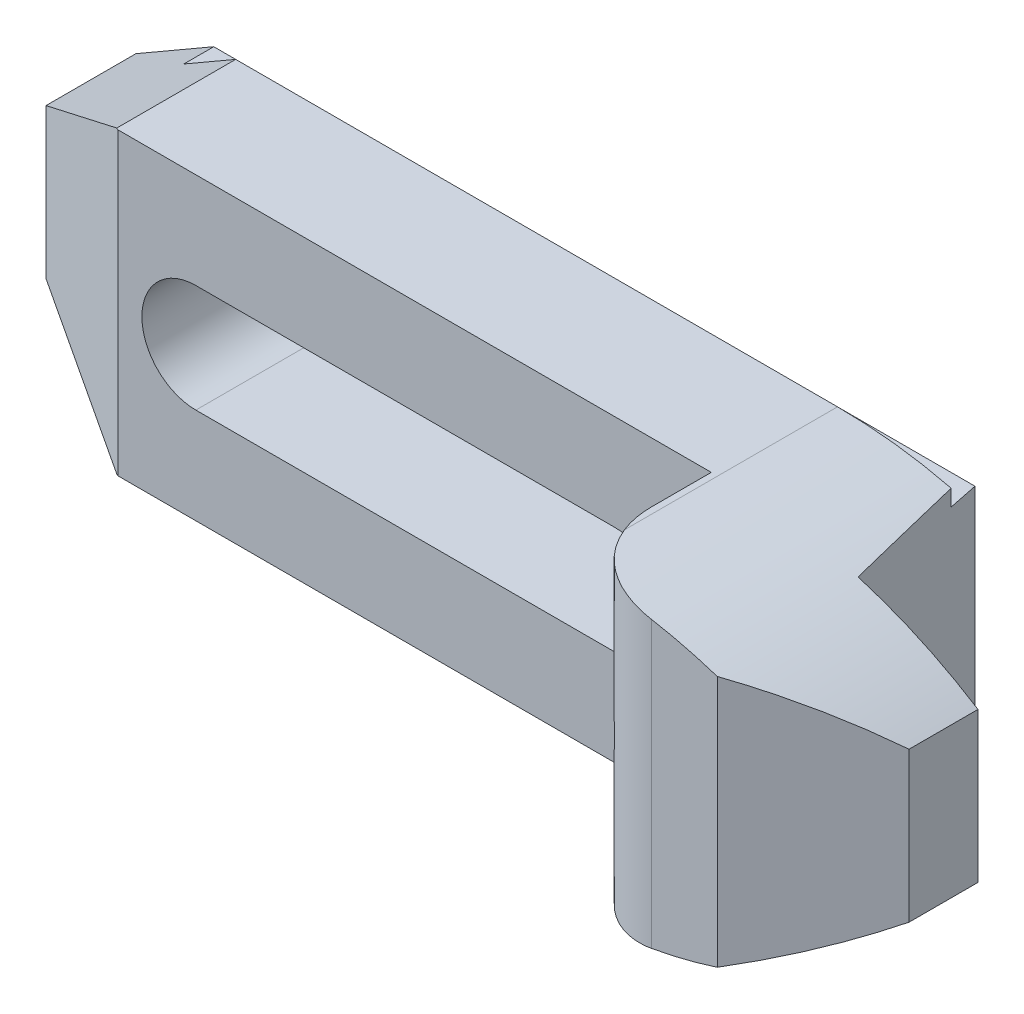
ISO-10303-21;
HEADER;
FILE_DESCRIPTION(('STEP AP214'),'2;1');
FILE_NAME('part.step','',(''),(''),'','','');
FILE_SCHEMA(('AUTOMOTIVE_DESIGN { 1 0 10303 214 1 1 1 1 }'));
ENDSEC;
DATA;
#1=APPLICATION_CONTEXT('core data for automotive mechanical design processes');
#2=APPLICATION_PROTOCOL_DEFINITION('international standard','automotive_design',2000,#1);
#3=PRODUCT_CONTEXT('',#1,'mechanical');
#4=PRODUCT('Part','Part','',(#3));
#5=PRODUCT_RELATED_PRODUCT_CATEGORY('part','',(#4));
#6=PRODUCT_DEFINITION_FORMATION('','',#4);
#7=PRODUCT_DEFINITION_CONTEXT('part definition',#1,'design');
#8=PRODUCT_DEFINITION('design','',#6,#7);
#9=PRODUCT_DEFINITION_SHAPE('','',#8);
#10=(LENGTH_UNIT() NAMED_UNIT(*) SI_UNIT(.MILLI.,.METRE.));
#11=(NAMED_UNIT(*) PLANE_ANGLE_UNIT() SI_UNIT($,.RADIAN.));
#12=(NAMED_UNIT(*) SI_UNIT($,.STERADIAN.) SOLID_ANGLE_UNIT());
#13=UNCERTAINTY_MEASURE_WITH_UNIT(LENGTH_MEASURE(1.E-05),#10,'distance_accuracy_value','');
#14=(GEOMETRIC_REPRESENTATION_CONTEXT(3) GLOBAL_UNCERTAINTY_ASSIGNED_CONTEXT((#13)) GLOBAL_UNIT_ASSIGNED_CONTEXT((#10,
#11,#12)) REPRESENTATION_CONTEXT('',''));
#15=CARTESIAN_POINT('',(0.,0.,0.));
#16=DIRECTION('',(0.,0.,1.));
#17=DIRECTION('',(1.,0.,0.));
#18=AXIS2_PLACEMENT_3D('',#15,#16,#17);
#19=CARTESIAN_POINT('',(-105.,25.,0.));
#20=DIRECTION('',(0.,0.,-1.));
#21=DIRECTION('',(-1.,0.,0.));
#22=AXIS2_PLACEMENT_3D('',#19,#20,#21);
#23=PLANE('',#22);
#24=DIRECTION('',(0.,-1.,0.));
#25=VECTOR('',#24,1.);
#26=CARTESIAN_POINT('',(35.,25.,0.));
#27=LINE('',#26,#25);
#28=CARTESIAN_POINT('',(35.,20.,0.));
#29=VERTEX_POINT('',#28);
#30=CARTESIAN_POINT('',(35.,-20.,0.));
#31=VERTEX_POINT('',#30);
#32=EDGE_CURVE('E506',#29,#31,#27,.T.);
#33=ORIENTED_EDGE('',*,*,#32,.T.);
#34=DIRECTION('',(-1.,0.,0.));
#35=VECTOR('',#34,1.);
#36=CARTESIAN_POINT('',(60.,-20.,0.));
#37=LINE('',#36,#35);
#38=CARTESIAN_POINT('',(-92.0096189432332,-20.,0.));
#39=VERTEX_POINT('',#38);
#40=EDGE_CURVE('E29',#31,#39,#37,.T.);
#41=ORIENTED_EDGE('',*,*,#40,.T.);
#42=DIRECTION('',(0.866025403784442,-0.5,0.));
#43=VECTOR('',#42,1.);
#44=CARTESIAN_POINT('',(-105.,-12.5,0.));
#45=LINE('',#44,#43);
#46=CARTESIAN_POINT('',(-105.,-12.5,0.));
#47=VERTEX_POINT('',#46);
#48=EDGE_CURVE('E288',#47,#39,#45,.T.);
#49=ORIENTED_EDGE('',*,*,#48,.F.);
#50=DIRECTION('',(0.,-1.,0.));
#51=VECTOR('',#50,1.);
#52=CARTESIAN_POINT('',(-105.,25.,0.));
#53=LINE('',#52,#51);
#54=CARTESIAN_POINT('',(-105.,12.5,0.));
#55=VERTEX_POINT('',#54);
#56=EDGE_CURVE('E255',#55,#47,#53,.T.);
#57=ORIENTED_EDGE('',*,*,#56,.F.);
#58=DIRECTION('',(0.866025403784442,0.5,0.));
#59=VECTOR('',#58,1.);
#60=CARTESIAN_POINT('',(-105.,12.5,0.));
#61=LINE('',#60,#59);
#62=CARTESIAN_POINT('',(-92.0096189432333,20.,0.));
#63=VERTEX_POINT('',#62);
#64=EDGE_CURVE('E396',#55,#63,#61,.T.);
#65=ORIENTED_EDGE('',*,*,#64,.T.);
#66=DIRECTION('',(-1.,0.,0.));
#67=VECTOR('',#66,1.);
#68=CARTESIAN_POINT('',(60.,20.,0.));
#69=LINE('',#68,#67);
#70=EDGE_CURVE('E37',#29,#63,#69,.T.);
#71=ORIENTED_EDGE('',*,*,#70,.F.);
#72=EDGE_LOOP('',(#33,#41,#49,#57,#65,#71));
#73=FACE_BOUND('',#72,.T.);
#74=DIRECTION('',(-1.,0.,0.));
#75=VECTOR('',#74,1.);
#76=CARTESIAN_POINT('',(0.,-9.,0.));
#77=LINE('',#76,#75);
#78=CARTESIAN_POINT('',(0.,-9.,0.));
#79=VERTEX_POINT('',#78);
#80=CARTESIAN_POINT('',(-70.,-9.,0.));
#81=VERTEX_POINT('',#80);
#82=EDGE_CURVE('E408',#79,#81,#77,.T.);
#83=ORIENTED_EDGE('',*,*,#82,.F.);
#84=CARTESIAN_POINT('',(0.,0.,0.));
#85=DIRECTION('',(0.,0.,1.));
#86=DIRECTION('',(1.,0.,0.));
#87=AXIS2_PLACEMENT_3D('',#84,#85,#86);
#88=CIRCLE('',#87,9.);
#89=CARTESIAN_POINT('',(0.,9.,0.));
#90=VERTEX_POINT('',#89);
#91=EDGE_CURVE('E409',#79,#90,#88,.T.);
#92=ORIENTED_EDGE('',*,*,#91,.T.);
#93=DIRECTION('',(1.,0.,0.));
#94=VECTOR('',#93,1.);
#95=CARTESIAN_POINT('',(-70.,9.,0.));
#96=LINE('',#95,#94);
#97=CARTESIAN_POINT('',(-70.,9.,0.));
#98=VERTEX_POINT('',#97);
#99=EDGE_CURVE('E412',#98,#90,#96,.T.);
#100=ORIENTED_EDGE('',*,*,#99,.F.);
#101=CARTESIAN_POINT('',(-70.,0.,0.));
#102=DIRECTION('',(0.,0.,1.));
#103=DIRECTION('',(1.,0.,0.));
#104=AXIS2_PLACEMENT_3D('',#101,#102,#103);
#105=CIRCLE('',#104,9.);
#106=EDGE_CURVE('E416',#98,#81,#105,.T.);
#107=ORIENTED_EDGE('',*,*,#106,.T.);
#108=EDGE_LOOP('',(#83,#92,#100,#107));
#109=FACE_BOUND('',#108,.T.);
#110=ADVANCED_FACE('F14',(#73,#109),#23,.T.);
#111=CARTESIAN_POINT('',(31.,25.,35.));
#112=DIRECTION('',(0.,1.,0.));
#113=DIRECTION('',(0.,0.,1.));
#114=AXIS2_PLACEMENT_3D('',#111,#112,#113);
#115=PLANE('',#114);
#116=DIRECTION('',(0.,0.,-1.));
#117=VECTOR('',#116,1.);
#118=CARTESIAN_POINT('',(17.061089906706,25.,50.));
#119=LINE('',#118,#117);
#120=CARTESIAN_POINT('',(17.061089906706,25.,40.5413703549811));
#121=VERTEX_POINT('',#120);
#122=CARTESIAN_POINT('',(17.061089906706,25.,5.));
#123=VERTEX_POINT('',#122);
#124=EDGE_CURVE('E387',#121,#123,#119,.T.);
#125=ORIENTED_EDGE('',*,*,#124,.T.);
#126=DIRECTION('',(-1.,0.,0.));
#127=VECTOR('',#126,1.);
#128=CARTESIAN_POINT('',(31.,25.,5.));
#129=LINE('',#128,#127);
#130=CARTESIAN_POINT('',(-83.3493649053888,25.,5.));
#131=VERTEX_POINT('',#130);
#132=EDGE_CURVE('E466',#123,#131,#129,.T.);
#133=ORIENTED_EDGE('',*,*,#132,.T.);
#134=DIRECTION('',(0.,0.,1.));
#135=VECTOR('',#134,1.);
#136=CARTESIAN_POINT('',(-83.3493649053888,25.,35.));
#137=LINE('',#136,#135);
#138=CARTESIAN_POINT('',(-83.3493649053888,25.,24.8411977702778));
#139=VERTEX_POINT('',#138);
#140=EDGE_CURVE('E391',#131,#139,#137,.T.);
#141=ORIENTED_EDGE('',*,*,#140,.T.);
#142=DIRECTION('',(-0.910366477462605,0.,-0.413802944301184));
#143=VECTOR('',#142,1.);
#144=CARTESIAN_POINT('',(-83.,25.,25.));
#145=LINE('',#144,#143);
#146=CARTESIAN_POINT('',(-83.,25.,25.));
#147=VERTEX_POINT('',#146);
#148=EDGE_CURVE('E257',#147,#139,#145,.T.);
#149=ORIENTED_EDGE('',*,*,#148,.F.);
#150=DIRECTION('',(-1.,0.,0.));
#151=VECTOR('',#150,1.);
#152=CARTESIAN_POINT('',(16.,25.,25.));
#153=LINE('',#152,#151);
#154=CARTESIAN_POINT('',(16.,25.,25.));
#155=VERTEX_POINT('',#154);
#156=EDGE_CURVE('E265',#155,#147,#153,.T.);
#157=ORIENTED_EDGE('',*,*,#156,.F.);
#158=DIRECTION('',(0.,0.,-1.));
#159=VECTOR('',#158,1.);
#160=CARTESIAN_POINT('',(16.,25.,35.));
#161=LINE('',#160,#159);
#162=CARTESIAN_POINT('',(16.,25.,35.));
#163=VERTEX_POINT('',#162);
#164=EDGE_CURVE('E261',#163,#155,#161,.T.);
#165=ORIENTED_EDGE('',*,*,#164,.F.);
#166=CARTESIAN_POINT('',(31.,25.,35.));
#167=DIRECTION('',(0.,1.,0.));
#168=DIRECTION('',(0.,0.,1.));
#169=AXIS2_PLACEMENT_3D('',#166,#167,#168);
#170=CIRCLE('',#169,15.);
#171=EDGE_CURVE('E258',#163,#121,#170,.T.);
#172=ORIENTED_EDGE('',*,*,#171,.T.);
#173=EDGE_LOOP('',(#125,#133,#141,#149,#157,#165,#172));
#174=FACE_BOUND('',#173,.T.);
#175=ADVANCED_FACE('F323',(#174),#115,.T.);
#176=CARTESIAN_POINT('',(17.061089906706,-55.,50.));
#177=DIRECTION('',(0.,0.,-1.));
#178=DIRECTION('',(-1.,0.,0.));
#179=AXIS2_PLACEMENT_3D('',#176,#177,#178);
#180=CYLINDRICAL_SURFACE('',#179,80.);
#181=CARTESIAN_POINT('',(17.061089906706,-55.,-87.900659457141));
#182=DIRECTION('',(-0.979804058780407,0.,0.199960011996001));
#183=DIRECTION('',(0.199960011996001,0.,0.979804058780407));
#184=AXIS2_PLACEMENT_3D('',#181,#182,#183);
#185=ELLIPSE('',#184,400.0799920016,80.);
#186=CARTESIAN_POINT('',(36.0204081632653,22.7209383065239,5.));
#187=VERTEX_POINT('',#186);
#188=CARTESIAN_POINT('',(40.,21.640762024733,24.5));
#189=VERTEX_POINT('',#188);
#190=EDGE_CURVE('E498',#187,#189,#185,.F.);
#191=ORIENTED_EDGE('',*,*,#190,.F.);
#192=CARTESIAN_POINT('',(17.061089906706,-55.,5.));
#193=DIRECTION('',(0.,0.,-1.));
#194=DIRECTION('',(-1.,0.,0.));
#195=AXIS2_PLACEMENT_3D('',#192,#193,#194);
#196=CIRCLE('',#195,80.);
#197=EDGE_CURVE('E189',#187,#123,#196,.F.);
#198=ORIENTED_EDGE('',*,*,#197,.T.);
#199=ORIENTED_EDGE('',*,*,#124,.F.);
#200=CARTESIAN_POINT('',(16.079880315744,24.9939824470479,36.5459717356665));
#201=CARTESIAN_POINT('',(16.1233139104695,24.9944917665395,36.9655874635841));
#202=CARTESIAN_POINT('',(16.1845366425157,24.9952301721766,37.3833529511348));
#203=CARTESIAN_POINT('',(16.3419252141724,24.9968123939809,38.212230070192));
#204=CARTESIAN_POINT('',(16.4380894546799,24.9976562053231,38.6233420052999));
#205=CARTESIAN_POINT('',(16.6646514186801,24.9990960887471,39.4357159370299));
#206=CARTESIAN_POINT('',(16.795025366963,24.9996923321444,39.8369845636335));
#207=CARTESIAN_POINT('',(17.089096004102,25.0001305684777,40.6271144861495));
#208=CARTESIAN_POINT('',(17.2527922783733,24.999972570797,41.015975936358));
#209=CARTESIAN_POINT('',(17.6124362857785,24.9983020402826,41.778717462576));
#210=CARTESIAN_POINT('',(17.8083997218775,24.9967888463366,42.1525901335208));
#211=CARTESIAN_POINT('',(18.2311211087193,24.991722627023,42.882486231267));
#212=CARTESIAN_POINT('',(18.4578789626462,24.9881696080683,43.2385097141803));
#213=CARTESIAN_POINT('',(18.9405322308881,24.9782840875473,43.9301194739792));
#214=CARTESIAN_POINT('',(19.1964239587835,24.9719519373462,44.2657083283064));
#215=CARTESIAN_POINT('',(19.7355169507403,24.9557385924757,44.9140896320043));
#216=CARTESIAN_POINT('',(20.018718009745,24.9458574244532,45.2268822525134));
#217=CARTESIAN_POINT('',(20.6096133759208,24.921806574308,45.8266633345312));
#218=CARTESIAN_POINT('',(20.9172436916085,24.9076478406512,46.1137152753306));
#219=CARTESIAN_POINT('',(21.5553652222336,24.8742983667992,46.6608538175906));
#220=CARTESIAN_POINT('',(21.8858564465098,24.8551076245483,46.9209404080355));
#221=CARTESIAN_POINT('',(22.5671997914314,24.8110221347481,47.4122625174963));
#222=CARTESIAN_POINT('',(22.9180489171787,24.7861282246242,47.6435022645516));
#223=CARTESIAN_POINT('',(23.6375273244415,24.7300485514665,48.0755524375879));
#224=CARTESIAN_POINT('',(24.0061564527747,24.6988628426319,48.2763631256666));
#225=CARTESIAN_POINT('',(24.7557969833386,24.6299701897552,48.6448948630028));
#226=CARTESIAN_POINT('',(25.1367040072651,24.5923102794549,48.8128370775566));
#227=CARTESIAN_POINT('',(25.9104924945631,24.50999583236,49.1162892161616));
#228=CARTESIAN_POINT('',(26.3033739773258,24.4653412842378,49.2517990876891));
#229=CARTESIAN_POINT('',(27.098355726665,24.3688457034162,49.4896300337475));
#230=CARTESIAN_POINT('',(27.5004594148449,24.3170019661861,49.5919385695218));
#231=CARTESIAN_POINT('',(28.3108058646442,24.2061306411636,49.7627810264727));
#232=CARTESIAN_POINT('',(28.7190487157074,24.1471029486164,49.8313144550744));
#233=CARTESIAN_POINT('',(29.539387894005,24.0219240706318,49.9344494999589));
#234=CARTESIAN_POINT('',(29.9514893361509,23.9557616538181,49.9689967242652));
#235=CARTESIAN_POINT('',(30.7760248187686,23.816720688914,50.0040041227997));
#236=CARTESIAN_POINT('',(31.1884588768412,23.7438417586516,50.0044623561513));
#237=CARTESIAN_POINT('',(32.0108401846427,23.5918539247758,49.9715560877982));
#238=CARTESIAN_POINT('',(32.420787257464,23.5127445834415,49.9381892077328));
#239=CARTESIAN_POINT('',(33.2354390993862,23.348990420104,49.8381774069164));
#240=CARTESIAN_POINT('',(33.6401444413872,23.2643462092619,49.7715361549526));
#241=CARTESIAN_POINT('',(34.0409114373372,23.1772707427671,49.688528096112));
#242=B_SPLINE_CURVE_WITH_KNOTS('',3,(#200,#201,#202,#203,#204,#205,#206,#207,#208,#209,#210,
#211,#212,#213,#214,#215,#216,#217,#218,#219,#220,#221,#222,#223,#224,#225,#226,#227,#228,#229,
#230,#231,#232,#233,#234,#235,#236,#237,#238,#239,#240,#241),.UNSPECIFIED.,.F.,.F.,(4,2,2,2,2,2,
2,2,2,2,2,2,2,2,2,2,2,2,2,2,4),(0.,1.26518724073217,2.53031658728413,3.7945690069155,
5.05880569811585,6.32365946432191,7.5885092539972,8.8531991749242,10.1178796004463,
11.3793501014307,12.6408211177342,13.9021070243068,15.1633820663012,16.4158541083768,
17.6683281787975,18.9212747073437,20.1742395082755,21.4292063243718,22.6842445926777,
23.9393711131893,25.194359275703),.UNSPECIFIED.);
#243=CARTESIAN_POINT('',(31.,23.7763085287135,50.));
#244=VERTEX_POINT('',#243);
#245=EDGE_CURVE('E375',#121,#244,#242,.T.);
#246=ORIENTED_EDGE('',*,*,#245,.T.);
#247=CARTESIAN_POINT('',(17.061089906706,-55.,50.));
#248=DIRECTION('',(0.,0.,-1.));
#249=DIRECTION('',(-1.,0.,0.));
#250=AXIS2_PLACEMENT_3D('',#247,#248,#249);
#251=CIRCLE('',#250,80.);
#252=CARTESIAN_POINT('',(42.,21.0134906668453,50.));
#253=VERTEX_POINT('',#252);
#254=EDGE_CURVE('E356',#244,#253,#251,.T.);
#255=ORIENTED_EDGE('',*,*,#254,.T.);
#256=CARTESIAN_POINT('',(17.061089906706,-55.,69.3969300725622));
#257=DIRECTION('',(0.613940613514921,0.,0.789352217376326));
#258=DIRECTION('',(0.789352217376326,0.,-0.613940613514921));
#259=AXIS2_PLACEMENT_3D('',#256,#257,#258);
#260=ELLIPSE('',#259,101.348926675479,80.);
#261=CARTESIAN_POINT('',(60.,12.5,36.));
#262=VERTEX_POINT('',#261);
#263=EDGE_CURVE('E364',#262,#253,#260,.T.);
#264=ORIENTED_EDGE('',*,*,#263,.F.);
#265=DIRECTION('',(0.,0.,-1.));
#266=VECTOR('',#265,1.);
#267=CARTESIAN_POINT('',(60.,12.5,50.));
#268=LINE('',#267,#266);
#269=CARTESIAN_POINT('',(60.,12.5,24.5));
#270=VERTEX_POINT('',#269);
#271=EDGE_CURVE('E385',#262,#270,#268,.T.);
#272=ORIENTED_EDGE('',*,*,#271,.T.);
#273=CARTESIAN_POINT('',(17.061089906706,-55.,24.5));
#274=DIRECTION('',(0.,0.,-1.));
#275=DIRECTION('',(-1.,0.,0.));
#276=AXIS2_PLACEMENT_3D('',#273,#274,#275);
#277=CIRCLE('',#276,80.);
#278=EDGE_CURVE('E382',#189,#270,#277,.T.);
#279=ORIENTED_EDGE('',*,*,#278,.F.);
#280=EDGE_LOOP('',(#191,#198,#199,#246,#255,#264,#272,#279));
#281=FACE_BOUND('',#280,.T.);
#282=ADVANCED_FACE('F312',(#281),#180,.T.);
#283=CARTESIAN_POINT('',(-105.,12.5,50.));
#284=DIRECTION('',(-0.5,0.866025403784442,0.));
#285=DIRECTION('',(-0.866025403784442,-0.5,0.));
#286=AXIS2_PLACEMENT_3D('',#283,#284,#285);
#287=PLANE('',#286);
#288=ORIENTED_EDGE('',*,*,#140,.F.);
#289=DIRECTION('',(-0.866025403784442,-0.5,0.));
#290=VECTOR('',#289,1.);
#291=CARTESIAN_POINT('',(-105.,12.5,5.));
#292=LINE('',#291,#290);
#293=CARTESIAN_POINT('',(-92.0096189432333,20.,5.));
#294=VERTEX_POINT('',#293);
#295=EDGE_CURVE('E203',#131,#294,#292,.T.);
#296=ORIENTED_EDGE('',*,*,#295,.T.);
#297=DIRECTION('',(0.,0.,-1.));
#298=VECTOR('',#297,1.);
#299=CARTESIAN_POINT('',(-92.0096189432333,20.,50.));
#300=LINE('',#299,#298);
#301=EDGE_CURVE('E206',#294,#63,#300,.T.);
#302=ORIENTED_EDGE('',*,*,#301,.T.);
#303=ORIENTED_EDGE('',*,*,#64,.F.);
#304=DIRECTION('',(0.,0.,-1.));
#305=VECTOR('',#304,1.);
#306=CARTESIAN_POINT('',(-105.,12.5,50.));
#307=LINE('',#306,#305);
#308=CARTESIAN_POINT('',(-105.,12.5,15.));
#309=VERTEX_POINT('',#308);
#310=EDGE_CURVE('E393',#309,#55,#307,.T.);
#311=ORIENTED_EDGE('',*,*,#310,.F.);
#312=DIRECTION('',(-0.805837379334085,-0.46525042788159,-0.366289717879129));
#313=VECTOR('',#312,1.);
#314=CARTESIAN_POINT('',(-83.0756228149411,25.1580450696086,24.9656259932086));
#315=LINE('',#314,#313);
#316=EDGE_CURVE('E230',#139,#309,#315,.T.);
#317=ORIENTED_EDGE('',*,*,#316,.F.);
#318=EDGE_LOOP('',(#288,#296,#302,#303,#311,#317));
#319=FACE_BOUND('',#318,.T.);
#320=ADVANCED_FACE('F450',(#319),#287,.T.);
#321=CARTESIAN_POINT('',(31.,25.,35.));
#322=DIRECTION('',(0.,-1.,0.));
#323=DIRECTION('',(0.,0.,-1.));
#324=AXIS2_PLACEMENT_3D('',#321,#322,#323);
#325=CYLINDRICAL_SURFACE('',#324,15.);
#326=CARTESIAN_POINT('',(16.,-13.6014705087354,35.));
#327=CARTESIAN_POINT('',(15.9999983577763,-13.6014691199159,35.1412210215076));
#328=CARTESIAN_POINT('',(16.0019949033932,-13.5991242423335,35.2824236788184));
#329=CARTESIAN_POINT('',(16.0099637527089,-13.5897430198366,35.5645570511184));
#330=CARTESIAN_POINT('',(16.0159359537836,-13.5827067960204,35.705487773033));
#331=CARTESIAN_POINT('',(16.039779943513,-13.5545604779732,36.127435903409));
#332=CARTESIAN_POINT('',(16.0635791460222,-13.5264127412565,36.4077042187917));
#333=CARTESIAN_POINT('',(16.126417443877,-13.4514322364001,36.9633040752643));
#334=CARTESIAN_POINT('',(16.1654218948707,-13.4046419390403,37.2386453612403));
#335=CARTESIAN_POINT('',(16.2578518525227,-13.2923863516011,37.7830340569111));
#336=CARTESIAN_POINT('',(16.3112772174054,-13.226921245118,38.0520815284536));
#337=CARTESIAN_POINT('',(16.4314348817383,-13.0773522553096,38.5820050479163));
#338=CARTESIAN_POINT('',(16.498172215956,-12.9932413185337,38.8428779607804));
#339=CARTESIAN_POINT('',(16.6435073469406,-12.8065469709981,39.3545205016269));
#340=CARTESIAN_POINT('',(16.7221055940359,-12.7039628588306,39.6052897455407));
#341=CARTESIAN_POINT('',(16.8894390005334,-12.4806369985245,40.0949988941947));
#342=CARTESIAN_POINT('',(16.9781718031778,-12.3598994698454,40.3339415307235));
#343=CARTESIAN_POINT('',(17.1638716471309,-12.1006988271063,40.7986348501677));
#344=CARTESIAN_POINT('',(17.2608386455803,-11.9622358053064,41.0243856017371));
#345=CARTESIAN_POINT('',(17.4605035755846,-11.6688537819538,41.4605986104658));
#346=CARTESIAN_POINT('',(17.5631747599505,-11.5140089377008,41.6711230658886));
#347=CARTESIAN_POINT('',(17.7725546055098,-11.1881105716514,42.0772103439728));
#348=CARTESIAN_POINT('',(17.8792648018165,-11.0170508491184,42.2727673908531));
#349=CARTESIAN_POINT('',(18.0945991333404,-10.6596904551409,42.6483666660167));
#350=CARTESIAN_POINT('',(18.2032237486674,-10.4733859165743,42.8284049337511));
#351=CARTESIAN_POINT('',(18.4202884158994,-10.0867297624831,43.1726533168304));
#352=CARTESIAN_POINT('',(18.528728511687,-9.88638217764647,43.3368679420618));
#353=CARTESIAN_POINT('',(18.7526465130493,-9.45526875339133,43.66283318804));
#354=CARTESIAN_POINT('',(18.8679438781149,-9.22336339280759,43.8232005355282));
#355=CARTESIAN_POINT('',(19.0939357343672,-8.74593532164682,44.1258598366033));
#356=CARTESIAN_POINT('',(19.204630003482,-8.50041195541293,44.2681509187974));
#357=CARTESIAN_POINT('',(19.4195441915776,-7.99725963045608,44.5353266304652));
#358=CARTESIAN_POINT('',(19.5237619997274,-7.73962677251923,44.6602056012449));
#359=CARTESIAN_POINT('',(19.7240779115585,-7.21386988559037,44.8932905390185));
#360=CARTESIAN_POINT('',(19.8201751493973,-6.9457447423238,45.001494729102));
#361=CARTESIAN_POINT('',(20.0168947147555,-6.35875786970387,45.2174312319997));
#362=CARTESIAN_POINT('',(20.1159579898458,-6.0384123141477,45.3225558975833));
#363=CARTESIAN_POINT('',(20.2998649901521,-5.38792799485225,45.5130698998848));
#364=CARTESIAN_POINT('',(20.3847074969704,-5.05778839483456,45.5984575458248));
#365=CARTESIAN_POINT('',(20.5389710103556,-4.38956771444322,45.7507502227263));
#366=CARTESIAN_POINT('',(20.608384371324,-4.05148278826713,45.8176460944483));
#367=CARTESIAN_POINT('',(20.7308287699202,-3.36939700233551,45.9339489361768));
#368=CARTESIAN_POINT('',(20.7838589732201,-3.02539584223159,45.9833550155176));
#369=CARTESIAN_POINT('',(20.8800257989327,-2.27779292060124,46.0720870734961));
#370=CARTESIAN_POINT('',(20.9202195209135,-1.87346591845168,46.1085331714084));
#371=CARTESIAN_POINT('',(20.9770871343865,-1.06178450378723,46.1598686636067));
#372=CARTESIAN_POINT('',(20.9937586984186,-0.654429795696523,46.1747559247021));
#373=CARTESIAN_POINT('',(21.0033441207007,0.161119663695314,46.1833321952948));
#374=CARTESIAN_POINT('',(20.9962385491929,0.569314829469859,46.1770038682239));
#375=CARTESIAN_POINT('',(20.9583284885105,1.3837096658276,46.1429561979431));
#376=CARTESIAN_POINT('',(20.92752372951,1.78990931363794,46.1152366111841));
#377=CARTESIAN_POINT('',(20.8394889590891,2.62795927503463,46.0348480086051));
#378=CARTESIAN_POINT('',(20.7804573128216,3.05945976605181,45.9804703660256));
#379=CARTESIAN_POINT('',(20.6365910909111,3.91392546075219,45.8447926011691));
#380=CARTESIAN_POINT('',(20.551753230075,4.336889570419,45.7634890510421));
#381=CARTESIAN_POINT('',(20.3580932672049,5.17018462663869,45.572054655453));
#382=CARTESIAN_POINT('',(20.2492959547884,5.58052813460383,45.4619535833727));
#383=CARTESIAN_POINT('',(20.0101852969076,6.38501278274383,45.2104880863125));
#384=CARTESIAN_POINT('',(19.879878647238,6.7791589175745,45.0691333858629));
#385=CARTESIAN_POINT('',(19.6336968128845,7.45763443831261,44.7894456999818));
#386=CARTESIAN_POINT('',(19.5215137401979,7.74618452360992,44.6580560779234));
#387=CARTESIAN_POINT('',(19.2886088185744,8.30916931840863,44.3742738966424));
#388=CARTESIAN_POINT('',(19.1678881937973,8.58360604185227,44.2218843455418));
#389=CARTESIAN_POINT('',(18.9204392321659,9.11609208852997,43.8952874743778));
#390=CARTESIAN_POINT('',(18.7937144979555,9.37415102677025,43.7210931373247));
#391=CARTESIAN_POINT('',(18.5370762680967,9.87194106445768,43.3502312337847));
#392=CARTESIAN_POINT('',(18.4071627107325,10.1116718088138,43.1535632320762));
#393=CARTESIAN_POINT('',(18.1464717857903,10.5724237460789,42.7361342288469));
#394=CARTESIAN_POINT('',(18.0156949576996,10.7932972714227,42.5152094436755));
#395=CARTESIAN_POINT('',(17.757822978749,11.2125068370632,42.0509032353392));
#396=CARTESIAN_POINT('',(17.630727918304,11.4108423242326,41.8075212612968));
#397=CARTESIAN_POINT('',(17.3839663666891,11.7833635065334,41.2994721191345));
#398=CARTESIAN_POINT('',(17.2642988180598,11.9575526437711,41.034807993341));
#399=CARTESIAN_POINT('',(17.0360338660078,12.280582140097,40.4859745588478));
#400=CARTESIAN_POINT('',(16.9274346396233,12.429426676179,40.2018084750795));
#401=CARTESIAN_POINT('',(16.7373747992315,12.6839373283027,39.6530618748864));
#402=CARTESIAN_POINT('',(16.6542187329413,12.7926766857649,39.3904874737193));
#403=CARTESIAN_POINT('',(16.5009210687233,12.9898116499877,38.854149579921));
#404=CARTESIAN_POINT('',(16.430778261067,13.0782091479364,38.5803871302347));
#405=CARTESIAN_POINT('',(16.3052359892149,13.2343994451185,38.0240915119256));
#406=CARTESIAN_POINT('',(16.2498206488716,13.3022144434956,37.7415681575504));
#407=CARTESIAN_POINT('',(16.1549440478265,13.417277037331,37.1698519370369));
#408=CARTESIAN_POINT('',(16.1154759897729,13.4645333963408,36.8806619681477));
#409=CARTESIAN_POINT('',(16.0564381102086,13.5348729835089,36.3265387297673));
#410=CARTESIAN_POINT('',(16.0352942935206,13.5598750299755,36.0620137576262));
#411=CARTESIAN_POINT('',(16.0070657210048,13.5931573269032,35.5316629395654));
#412=CARTESIAN_POINT('',(15.9999549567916,13.6014685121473,35.2658404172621));
#413=CARTESIAN_POINT('',(16.,13.6014705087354,35.));
#414=B_SPLINE_CURVE_WITH_KNOTS('',3,(#326,#327,#328,#329,#330,#331,#332,#333,#334,#335,#336,
#337,#338,#339,#340,#341,#342,#343,#344,#345,#346,#347,#348,#349,#350,#351,#352,#353,#354,#355,
#356,#357,#358,#359,#360,#361,#362,#363,#364,#365,#366,#367,#368,#369,#370,#371,#372,#373,#374,
#375,#376,#377,#378,#379,#380,#381,#382,#383,#384,#385,#386,#387,#388,#389,#390,#391,#392,#393,
#394,#395,#396,#397,#398,#399,#400,#401,#402,#403,#404,#405,#406,#407,#408,#409,#410,#411,#412,
#413),.UNSPECIFIED.,.F.,.F.,(4,2,2,2,2,2,2,2,2,2,2,2,2,2,2,2,2,2,2,2,2,2,2,2,2,2,2,2,2,2,2,2,2,
2,2,2,2,2,2,2,2,2,2,4),(0.,0.423592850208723,0.847174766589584,1.69405475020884,
2.53901633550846,3.38396961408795,4.2292430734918,5.07454863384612,5.91965801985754,
6.76476300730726,7.6061940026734,8.44794807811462,9.28991634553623,10.1316439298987,
11.0445679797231,11.9575360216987,12.8708000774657,13.7841613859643,14.8373349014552,
15.8905986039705,16.9443830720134,17.9982211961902,19.2207657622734,20.4434312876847,
21.667096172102,22.8907749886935,24.2058380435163,25.5210685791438,26.8349446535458,
28.1484124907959,29.1563983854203,30.1642400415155,31.1714844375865,32.1787483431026,
33.1932886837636,34.2078539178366,35.2222743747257,36.2365274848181,37.1237191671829,
38.0108283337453,38.8969772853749,39.7827481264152,40.5814933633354,41.3787568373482),.UNSPECIFIED.);
#415=CARTESIAN_POINT('',(16.,-13.6014705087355,35.));
#416=VERTEX_POINT('',#415);
#417=CARTESIAN_POINT('',(16.,13.6014705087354,35.));
#418=VERTEX_POINT('',#417);
#419=EDGE_CURVE('E413',#416,#418,#414,.T.);
#420=ORIENTED_EDGE('',*,*,#419,.F.);
#421=DIRECTION('',(0.,-1.,0.));
#422=VECTOR('',#421,1.);
#423=CARTESIAN_POINT('',(16.,25.,35.));
#424=LINE('',#423,#422);
#425=CARTESIAN_POINT('',(16.,-25.,35.));
#426=VERTEX_POINT('',#425);
#427=EDGE_CURVE('E245',#416,#426,#424,.T.);
#428=ORIENTED_EDGE('',*,*,#427,.T.);
#429=CARTESIAN_POINT('',(31.,-25.,35.));
#430=DIRECTION('',(0.,1.,0.));
#431=DIRECTION('',(0.,0.,1.));
#432=AXIS2_PLACEMENT_3D('',#429,#430,#431);
#433=CIRCLE('',#432,15.);
#434=CARTESIAN_POINT('',(17.061089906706,-25.,40.5413703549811));
#435=VERTEX_POINT('',#434);
#436=EDGE_CURVE('E269',#426,#435,#433,.T.);
#437=ORIENTED_EDGE('',*,*,#436,.T.);
#438=CARTESIAN_POINT('',(16.845357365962,-24.999709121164,39.9644830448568));
#439=CARTESIAN_POINT('',(16.9848982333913,-25.0000699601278,40.362477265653));
#440=CARTESIAN_POINT('',(17.1413066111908,-25.0001419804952,40.7545507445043));
#441=CARTESIAN_POINT('',(17.486556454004,-24.9990589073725,41.5241348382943));
#442=CARTESIAN_POINT('',(17.675397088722,-24.997903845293,41.9016458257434));
#443=CARTESIAN_POINT('',(18.0841580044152,-24.9937178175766,42.6392981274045));
#444=CARTESIAN_POINT('',(18.3040693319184,-24.9906873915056,42.9994444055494));
#445=CARTESIAN_POINT('',(18.7734198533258,-24.9820169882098,43.699910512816));
#446=CARTESIAN_POINT('',(19.0228584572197,-24.9763770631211,44.0402307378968));
#447=CARTESIAN_POINT('',(19.5492622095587,-24.9617297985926,44.6983516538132));
#448=CARTESIAN_POINT('',(19.8262053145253,-24.9527251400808,45.0161700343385));
#449=CARTESIAN_POINT('',(20.4057690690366,-24.930577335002,45.6273049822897));
#450=CARTESIAN_POINT('',(20.7083895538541,-24.9174342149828,45.9206217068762));
#451=CARTESIAN_POINT('',(21.3369719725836,-24.8862678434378,46.4805479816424));
#452=CARTESIAN_POINT('',(21.6629252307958,-24.8682463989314,46.747167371));
#453=CARTESIAN_POINT('',(22.335849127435,-24.8266279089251,47.2519133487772));
#454=CARTESIAN_POINT('',(22.6828192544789,-24.803030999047,47.4900406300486));
#455=CARTESIAN_POINT('',(23.3930395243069,-24.7498115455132,47.9347844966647));
#456=CARTESIAN_POINT('',(23.75617905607,-24.7202261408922,48.1415821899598));
#457=CARTESIAN_POINT('',(24.4979847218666,-24.6544488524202,48.5239758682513));
#458=CARTESIAN_POINT('',(24.8766516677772,-24.6182566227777,48.699570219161));
#459=CARTESIAN_POINT('',(25.6466415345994,-24.5389093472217,49.0183878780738));
#460=CARTESIAN_POINT('',(26.0379639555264,-24.495754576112,49.1616124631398));
#461=CARTESIAN_POINT('',(26.8303264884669,-24.4022735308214,49.4148092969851));
#462=CARTESIAN_POINT('',(27.2313644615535,-24.3519488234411,49.5247887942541));
#463=CARTESIAN_POINT('',(27.9125144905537,-24.2611169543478,49.6815581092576));
#464=CARTESIAN_POINT('',(28.1908509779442,-24.2225230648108,49.7373364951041));
#465=CARTESIAN_POINT('',(28.7497640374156,-24.1419900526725,49.8329631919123));
#466=CARTESIAN_POINT('',(29.0303404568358,-24.1000511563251,49.8728125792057));
#467=CARTESIAN_POINT('',(29.5922669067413,-24.0129750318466,49.9364681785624));
#468=CARTESIAN_POINT('',(29.8736145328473,-23.9678438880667,49.9603040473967));
#469=CARTESIAN_POINT('',(30.4367318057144,-23.8744189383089,49.9920760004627));
#470=CARTESIAN_POINT('',(30.7185015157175,-23.8261245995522,50.000009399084));
#471=CARTESIAN_POINT('',(31.,-23.7763085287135,50.));
#472=B_SPLINE_CURVE_WITH_KNOTS('',3,(#438,#439,#440,#441,#442,#443,#444,#445,#446,#447,#448,
#449,#450,#451,#452,#453,#454,#455,#456,#457,#458,#459,#460,#461,#462,#463,#464,#465,#466,#467,
#468,#469,#470,#471),.UNSPECIFIED.,.F.,.F.,(4,2,2,2,2,2,2,2,2,2,2,2,2,2,2,2,4),(0.,
1.26486000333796,2.52968762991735,3.79415151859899,5.05859014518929,6.32202344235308,
7.58544863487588,8.84840647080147,10.1113335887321,11.3666559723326,12.6220440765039,
13.8773826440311,15.1324473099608,15.991460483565,16.850415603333,17.707775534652,
18.56528024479),.UNSPECIFIED.);
#473=CARTESIAN_POINT('',(31.,-23.7763085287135,50.));
#474=VERTEX_POINT('',#473);
#475=EDGE_CURVE('E291',#435,#474,#472,.T.);
#476=ORIENTED_EDGE('',*,*,#475,.T.);
#477=DIRECTION('',(0.,-1.,0.));
#478=VECTOR('',#477,1.);
#479=CARTESIAN_POINT('',(31.,25.,50.));
#480=LINE('',#479,#478);
#481=EDGE_CURVE('E246',#244,#474,#480,.T.);
#482=ORIENTED_EDGE('',*,*,#481,.F.);
#483=ORIENTED_EDGE('',*,*,#245,.F.);
#484=ORIENTED_EDGE('',*,*,#171,.F.);
#485=EDGE_CURVE('E242',#163,#418,#424,.T.);
#486=ORIENTED_EDGE('',*,*,#485,.T.);
#487=EDGE_LOOP('',(#420,#428,#437,#476,#482,#483,#484,#486));
#488=FACE_BOUND('',#487,.T.);
#489=ADVANCED_FACE('F301',(#488),#325,.T.);
#490=CARTESIAN_POINT('',(16.,25.,35.));
#491=DIRECTION('',(-1.,0.,0.));
#492=DIRECTION('',(0.,0.,1.));
#493=AXIS2_PLACEMENT_3D('',#490,#491,#492);
#494=PLANE('',#493);
#495=DIRECTION('',(0.,-1.,0.));
#496=VECTOR('',#495,1.);
#497=CARTESIAN_POINT('',(16.,25.,25.));
#498=LINE('',#497,#496);
#499=CARTESIAN_POINT('',(16.,13.6014705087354,25.));
#500=VERTEX_POINT('',#499);
#501=EDGE_CURVE('E238',#155,#500,#498,.T.);
#502=ORIENTED_EDGE('',*,*,#501,.T.);
#503=DIRECTION('',(0.,0.,-1.));
#504=VECTOR('',#503,1.);
#505=CARTESIAN_POINT('',(16.,13.6014705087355,55.));
#506=LINE('',#505,#504);
#507=EDGE_CURVE('E214',#500,#418,#506,.F.);
#508=ORIENTED_EDGE('',*,*,#507,.T.);
#509=ORIENTED_EDGE('',*,*,#485,.F.);
#510=ORIENTED_EDGE('',*,*,#164,.T.);
#511=EDGE_LOOP('',(#502,#508,#509,#510));
#512=FACE_BOUND('',#511,.T.);
#513=ADVANCED_FACE('F457',(#512),#494,.T.);
#514=ORIENTED_EDGE('',*,*,#427,.F.);
#515=DIRECTION('',(0.,0.,-1.));
#516=VECTOR('',#515,1.);
#517=CARTESIAN_POINT('',(16.,-13.6014705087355,55.));
#518=LINE('',#517,#516);
#519=CARTESIAN_POINT('',(16.,-13.6014705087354,25.));
#520=VERTEX_POINT('',#519);
#521=EDGE_CURVE('E217',#416,#520,#518,.T.);
#522=ORIENTED_EDGE('',*,*,#521,.T.);
#523=CARTESIAN_POINT('',(16.,-25.,25.));
#524=VERTEX_POINT('',#523);
#525=EDGE_CURVE('E241',#520,#524,#498,.T.);
#526=ORIENTED_EDGE('',*,*,#525,.T.);
#527=DIRECTION('',(0.,0.,-1.));
#528=VECTOR('',#527,1.);
#529=CARTESIAN_POINT('',(16.,-25.,35.));
#530=LINE('',#529,#528);
#531=EDGE_CURVE('E272',#426,#524,#530,.T.);
#532=ORIENTED_EDGE('',*,*,#531,.F.);
#533=EDGE_LOOP('',(#514,#522,#526,#532));
#534=FACE_BOUND('',#533,.T.);
#535=ADVANCED_FACE('F494',(#534),#494,.T.);
#536=CARTESIAN_POINT('',(16.,25.,25.));
#537=DIRECTION('',(0.,0.,1.));
#538=DIRECTION('',(1.,0.,0.));
#539=AXIS2_PLACEMENT_3D('',#536,#537,#538);
#540=PLANE('',#539);
#541=CARTESIAN_POINT('',(0.,0.,25.));
#542=DIRECTION('',(0.,0.,1.));
#543=DIRECTION('',(1.,0.,0.));
#544=AXIS2_PLACEMENT_3D('',#541,#542,#543);
#545=CIRCLE('',#544,21.);
#546=EDGE_CURVE('E427',#520,#500,#545,.T.);
#547=ORIENTED_EDGE('',*,*,#546,.T.);
#548=ORIENTED_EDGE('',*,*,#501,.F.);
#549=ORIENTED_EDGE('',*,*,#156,.T.);
#550=DIRECTION('',(0.,-1.,0.));
#551=VECTOR('',#550,1.);
#552=CARTESIAN_POINT('',(-83.,25.,25.));
#553=LINE('',#552,#551);
#554=CARTESIAN_POINT('',(-83.,-25.,25.));
#555=VERTEX_POINT('',#554);
#556=EDGE_CURVE('E235',#147,#555,#553,.T.);
#557=ORIENTED_EDGE('',*,*,#556,.T.);
#558=DIRECTION('',(-1.,0.,0.));
#559=VECTOR('',#558,1.);
#560=CARTESIAN_POINT('',(16.,-25.,25.));
#561=LINE('',#560,#559);
#562=EDGE_CURVE('E276',#524,#555,#561,.T.);
#563=ORIENTED_EDGE('',*,*,#562,.F.);
#564=ORIENTED_EDGE('',*,*,#525,.F.);
#565=EDGE_LOOP('',(#547,#548,#549,#557,#563,#564));
#566=FACE_BOUND('',#565,.T.);
#567=DIRECTION('',(-1.,0.,0.));
#568=VECTOR('',#567,1.);
#569=CARTESIAN_POINT('',(16.,9.,25.));
#570=LINE('',#569,#568);
#571=CARTESIAN_POINT('',(0.,9.,25.));
#572=VERTEX_POINT('',#571);
#573=CARTESIAN_POINT('',(-70.,9.,25.));
#574=VERTEX_POINT('',#573);
#575=EDGE_CURVE('E223',#572,#574,#570,.T.);
#576=ORIENTED_EDGE('',*,*,#575,.F.);
#577=CARTESIAN_POINT('',(0.,0.,25.));
#578=DIRECTION('',(0.,0.,1.));
#579=DIRECTION('',(1.,0.,0.));
#580=AXIS2_PLACEMENT_3D('',#577,#578,#579);
#581=CIRCLE('',#580,9.);
#582=CARTESIAN_POINT('',(0.,-9.,25.));
#583=VERTEX_POINT('',#582);
#584=EDGE_CURVE('E220',#572,#583,#581,.F.);
#585=ORIENTED_EDGE('',*,*,#584,.T.);
#586=DIRECTION('',(1.,0.,0.));
#587=VECTOR('',#586,1.);
#588=CARTESIAN_POINT('',(16.,-9.,25.));
#589=LINE('',#588,#587);
#590=CARTESIAN_POINT('',(-70.,-9.,25.));
#591=VERTEX_POINT('',#590);
#592=EDGE_CURVE('E228',#591,#583,#589,.T.);
#593=ORIENTED_EDGE('',*,*,#592,.F.);
#594=CARTESIAN_POINT('',(-70.,0.,25.));
#595=DIRECTION('',(0.,0.,1.));
#596=DIRECTION('',(1.,0.,0.));
#597=AXIS2_PLACEMENT_3D('',#594,#595,#596);
#598=CIRCLE('',#597,9.);
#599=EDGE_CURVE('E225',#591,#574,#598,.F.);
#600=ORIENTED_EDGE('',*,*,#599,.T.);
#601=EDGE_LOOP('',(#576,#585,#593,#600));
#602=FACE_BOUND('',#601,.T.);
#603=ADVANCED_FACE('F330',(#566,#602),#540,.T.);
#604=CARTESIAN_POINT('',(-105.,25.,15.));
#605=DIRECTION('',(-1.,0.,0.));
#606=DIRECTION('',(0.,0.,1.));
#607=AXIS2_PLACEMENT_3D('',#604,#605,#606);
#608=PLANE('',#607);
#609=DIRECTION('',(0.,-1.,0.));
#610=VECTOR('',#609,1.);
#611=CARTESIAN_POINT('',(-105.,25.,15.));
#612=LINE('',#611,#610);
#613=CARTESIAN_POINT('',(-105.,-12.5,15.));
#614=VERTEX_POINT('',#613);
#615=EDGE_CURVE('E233',#309,#614,#612,.T.);
#616=ORIENTED_EDGE('',*,*,#615,.F.);
#617=ORIENTED_EDGE('',*,*,#310,.T.);
#618=ORIENTED_EDGE('',*,*,#56,.T.);
#619=DIRECTION('',(0.,0.,-1.));
#620=VECTOR('',#619,1.);
#621=CARTESIAN_POINT('',(-105.,-12.5,50.));
#622=LINE('',#621,#620);
#623=EDGE_CURVE('E285',#614,#47,#622,.T.);
#624=ORIENTED_EDGE('',*,*,#623,.F.);
#625=EDGE_LOOP('',(#616,#617,#618,#624));
#626=FACE_BOUND('',#625,.T.);
#627=ADVANCED_FACE('F327',(#626),#608,.T.);
#628=CARTESIAN_POINT('',(-83.,25.,25.));
#629=DIRECTION('',(-0.413802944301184,0.,0.910366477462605));
#630=DIRECTION('',(0.910366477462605,0.,0.413802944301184));
#631=AXIS2_PLACEMENT_3D('',#628,#629,#630);
#632=PLANE('',#631);
#633=ORIENTED_EDGE('',*,*,#148,.T.);
#634=ORIENTED_EDGE('',*,*,#316,.T.);
#635=ORIENTED_EDGE('',*,*,#615,.T.);
#636=DIRECTION('',(-0.805837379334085,0.46525042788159,-0.366289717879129));
#637=VECTOR('',#636,1.);
#638=CARTESIAN_POINT('',(-101.821432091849,-14.3351470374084,16.4448035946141));
#639=LINE('',#638,#637);
#640=CARTESIAN_POINT('',(-83.3493649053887,-25.,24.8411977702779));
#641=VERTEX_POINT('',#640);
#642=EDGE_CURVE('E282',#641,#614,#639,.T.);
#643=ORIENTED_EDGE('',*,*,#642,.F.);
#644=DIRECTION('',(-0.910366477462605,0.,-0.413802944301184));
#645=VECTOR('',#644,1.);
#646=CARTESIAN_POINT('',(-83.,-25.,25.));
#647=LINE('',#646,#645);
#648=EDGE_CURVE('E262',#555,#641,#647,.T.);
#649=ORIENTED_EDGE('',*,*,#648,.F.);
#650=ORIENTED_EDGE('',*,*,#556,.F.);
#651=EDGE_LOOP('',(#633,#634,#635,#643,#649,#650));
#652=FACE_BOUND('',#651,.T.);
#653=ADVANCED_FACE('F16',(#652),#632,.T.);
#654=CARTESIAN_POINT('',(42.,25.,50.));
#655=DIRECTION('',(0.,0.,1.));
#656=DIRECTION('',(1.,0.,0.));
#657=AXIS2_PLACEMENT_3D('',#654,#655,#656);
#658=PLANE('',#657);
#659=DIRECTION('',(0.,-1.,0.));
#660=VECTOR('',#659,1.);
#661=CARTESIAN_POINT('',(42.,25.,50.));
#662=LINE('',#661,#660);
#663=CARTESIAN_POINT('',(42.,-21.0134906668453,50.));
#664=VERTEX_POINT('',#663);
#665=EDGE_CURVE('E249',#253,#664,#662,.T.);
#666=ORIENTED_EDGE('',*,*,#665,.F.);
#667=ORIENTED_EDGE('',*,*,#254,.F.);
#668=ORIENTED_EDGE('',*,*,#481,.T.);
#669=CARTESIAN_POINT('',(17.061089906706,55.,50.));
#670=DIRECTION('',(0.,0.,1.));
#671=DIRECTION('',(1.,0.,0.));
#672=AXIS2_PLACEMENT_3D('',#669,#670,#671);
#673=CIRCLE('',#672,80.);
#674=EDGE_CURVE('E359',#474,#664,#673,.T.);
#675=ORIENTED_EDGE('',*,*,#674,.T.);
#676=EDGE_LOOP('',(#666,#667,#668,#675));
#677=FACE_BOUND('',#676,.T.);
#678=ADVANCED_FACE('F344',(#677),#658,.T.);
#679=CARTESIAN_POINT('',(60.,25.,36.));
#680=DIRECTION('',(0.613940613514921,0.,0.789352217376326));
#681=DIRECTION('',(0.789352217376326,0.,-0.613940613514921));
#682=AXIS2_PLACEMENT_3D('',#679,#680,#681);
#683=PLANE('',#682);
#684=DIRECTION('',(0.,-1.,0.));
#685=VECTOR('',#684,1.);
#686=CARTESIAN_POINT('',(60.,25.,36.));
#687=LINE('',#686,#685);
#688=CARTESIAN_POINT('',(60.,-12.5,36.));
#689=VERTEX_POINT('',#688);
#690=EDGE_CURVE('E251',#262,#689,#687,.T.);
#691=ORIENTED_EDGE('',*,*,#690,.F.);
#692=ORIENTED_EDGE('',*,*,#263,.T.);
#693=ORIENTED_EDGE('',*,*,#665,.T.);
#694=CARTESIAN_POINT('',(17.061089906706,55.,69.3969300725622));
#695=DIRECTION('',(0.613940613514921,0.,0.789352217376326));
#696=DIRECTION('',(0.789352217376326,0.,-0.613940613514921));
#697=AXIS2_PLACEMENT_3D('',#694,#695,#696);
#698=ELLIPSE('',#697,101.348926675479,80.);
#699=EDGE_CURVE('E299',#689,#664,#698,.F.);
#700=ORIENTED_EDGE('',*,*,#699,.F.);
#701=EDGE_LOOP('',(#691,#692,#693,#700));
#702=FACE_BOUND('',#701,.T.);
#703=ADVANCED_FACE('F341',(#702),#683,.T.);
#704=CARTESIAN_POINT('',(60.,25.,24.5));
#705=DIRECTION('',(1.,0.,0.));
#706=DIRECTION('',(0.,0.,-1.));
#707=AXIS2_PLACEMENT_3D('',#704,#705,#706);
#708=PLANE('',#707);
#709=DIRECTION('',(0.,-1.,0.));
#710=VECTOR('',#709,1.);
#711=CARTESIAN_POINT('',(60.,25.,24.5));
#712=LINE('',#711,#710);
#713=CARTESIAN_POINT('',(60.,-12.5,24.5));
#714=VERTEX_POINT('',#713);
#715=EDGE_CURVE('E253',#270,#714,#712,.T.);
#716=ORIENTED_EDGE('',*,*,#715,.F.);
#717=ORIENTED_EDGE('',*,*,#271,.F.);
#718=ORIENTED_EDGE('',*,*,#690,.T.);
#719=DIRECTION('',(0.,0.,-1.));
#720=VECTOR('',#719,1.);
#721=CARTESIAN_POINT('',(60.,-12.5,50.));
#722=LINE('',#721,#720);
#723=EDGE_CURVE('E367',#689,#714,#722,.T.);
#724=ORIENTED_EDGE('',*,*,#723,.T.);
#725=EDGE_LOOP('',(#716,#717,#718,#724));
#726=FACE_BOUND('',#725,.T.);
#727=ADVANCED_FACE('F337',(#726),#708,.T.);
#728=CARTESIAN_POINT('',(45.,25.,24.5));
#729=DIRECTION('',(0.,0.,-1.));
#730=DIRECTION('',(-1.,0.,0.));
#731=AXIS2_PLACEMENT_3D('',#728,#729,#730);
#732=PLANE('',#731);
#733=CARTESIAN_POINT('',(17.061089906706,55.,24.5));
#734=DIRECTION('',(0.,0.,-1.));
#735=DIRECTION('',(-1.,0.,0.));
#736=AXIS2_PLACEMENT_3D('',#733,#734,#735);
#737=CIRCLE('',#736,80.);
#738=CARTESIAN_POINT('',(40.,-21.6407620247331,24.5));
#739=VERTEX_POINT('',#738);
#740=EDGE_CURVE('E368',#739,#714,#737,.F.);
#741=ORIENTED_EDGE('',*,*,#740,.F.);
#742=DIRECTION('',(0.,1.,0.));
#743=VECTOR('',#742,1.);
#744=CARTESIAN_POINT('',(40.,-25.,24.5));
#745=LINE('',#744,#743);
#746=EDGE_CURVE('E199',#739,#189,#745,.T.);
#747=ORIENTED_EDGE('',*,*,#746,.T.);
#748=ORIENTED_EDGE('',*,*,#278,.T.);
#749=ORIENTED_EDGE('',*,*,#715,.T.);
#750=EDGE_LOOP('',(#741,#747,#748,#749));
#751=FACE_BOUND('',#750,.T.);
#752=ADVANCED_FACE('F321',(#751),#732,.T.);
#753=CARTESIAN_POINT('',(31.,-25.,35.));
#754=DIRECTION('',(0.,1.,0.));
#755=DIRECTION('',(0.,0.,1.));
#756=AXIS2_PLACEMENT_3D('',#753,#754,#755);
#757=PLANE('',#756);
#758=DIRECTION('',(0.,0.,-1.));
#759=VECTOR('',#758,1.);
#760=CARTESIAN_POINT('',(-83.3493649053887,-25.,35.));
#761=LINE('',#760,#759);
#762=CARTESIAN_POINT('',(-83.3493649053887,-25.,5.));
#763=VERTEX_POINT('',#762);
#764=EDGE_CURVE('E273',#641,#763,#761,.T.);
#765=ORIENTED_EDGE('',*,*,#764,.T.);
#766=DIRECTION('',(1.,0.,0.));
#767=VECTOR('',#766,1.);
#768=CARTESIAN_POINT('',(31.,-25.,5.));
#769=LINE('',#768,#767);
#770=CARTESIAN_POINT('',(17.061089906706,-25.,5.));
#771=VERTEX_POINT('',#770);
#772=EDGE_CURVE('E475',#763,#771,#769,.T.);
#773=ORIENTED_EDGE('',*,*,#772,.T.);
#774=DIRECTION('',(0.,0.,-1.));
#775=VECTOR('',#774,1.);
#776=CARTESIAN_POINT('',(17.061089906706,-25.,50.));
#777=LINE('',#776,#775);
#778=EDGE_CURVE('E369',#435,#771,#777,.T.);
#779=ORIENTED_EDGE('',*,*,#778,.F.);
#780=ORIENTED_EDGE('',*,*,#436,.F.);
#781=ORIENTED_EDGE('',*,*,#531,.T.);
#782=ORIENTED_EDGE('',*,*,#562,.T.);
#783=ORIENTED_EDGE('',*,*,#648,.T.);
#784=EDGE_LOOP('',(#765,#773,#779,#780,#781,#782,#783));
#785=FACE_BOUND('',#784,.T.);
#786=ADVANCED_FACE('F317',(#785),#757,.F.);
#787=CARTESIAN_POINT('',(-105.,-12.5,50.));
#788=DIRECTION('',(0.5,0.866025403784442,0.));
#789=DIRECTION('',(-0.866025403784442,0.5,0.));
#790=AXIS2_PLACEMENT_3D('',#787,#788,#789);
#791=PLANE('',#790);
#792=DIRECTION('',(0.,0.,1.));
#793=VECTOR('',#792,1.);
#794=CARTESIAN_POINT('',(-92.0096189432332,-20.,50.));
#795=LINE('',#794,#793);
#796=CARTESIAN_POINT('',(-92.0096189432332,-20.,5.));
#797=VERTEX_POINT('',#796);
#798=EDGE_CURVE('E210',#39,#797,#795,.T.);
#799=ORIENTED_EDGE('',*,*,#798,.T.);
#800=DIRECTION('',(0.866025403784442,-0.5,0.));
#801=VECTOR('',#800,1.);
#802=CARTESIAN_POINT('',(-105.,-12.5,5.));
#803=LINE('',#802,#801);
#804=EDGE_CURVE('E187',#797,#763,#803,.T.);
#805=ORIENTED_EDGE('',*,*,#804,.T.);
#806=ORIENTED_EDGE('',*,*,#764,.F.);
#807=ORIENTED_EDGE('',*,*,#642,.T.);
#808=ORIENTED_EDGE('',*,*,#623,.T.);
#809=ORIENTED_EDGE('',*,*,#48,.T.);
#810=EDGE_LOOP('',(#799,#805,#806,#807,#808,#809));
#811=FACE_BOUND('',#810,.T.);
#812=ADVANCED_FACE('F311',(#811),#791,.F.);
#813=CARTESIAN_POINT('',(17.061089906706,55.,50.));
#814=DIRECTION('',(0.,0.,-1.));
#815=DIRECTION('',(-1.,0.,0.));
#816=AXIS2_PLACEMENT_3D('',#813,#814,#815);
#817=CYLINDRICAL_SURFACE('',#816,80.);
#818=CARTESIAN_POINT('',(17.061089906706,55.,5.));
#819=DIRECTION('',(0.,0.,1.));
#820=DIRECTION('',(1.,0.,0.));
#821=AXIS2_PLACEMENT_3D('',#818,#819,#820);
#822=CIRCLE('',#821,80.);
#823=CARTESIAN_POINT('',(36.0204081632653,-22.7209383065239,5.));
#824=VERTEX_POINT('',#823);
#825=EDGE_CURVE('E212',#771,#824,#822,.T.);
#826=ORIENTED_EDGE('',*,*,#825,.T.);
#827=CARTESIAN_POINT('',(17.061089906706,55.,-87.900659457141));
#828=DIRECTION('',(-0.979804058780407,0.,0.199960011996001));
#829=DIRECTION('',(0.199960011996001,0.,0.979804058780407));
#830=AXIS2_PLACEMENT_3D('',#827,#828,#829);
#831=ELLIPSE('',#830,400.079992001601,80.);
#832=EDGE_CURVE('E195',#739,#824,#831,.F.);
#833=ORIENTED_EDGE('',*,*,#832,.F.);
#834=ORIENTED_EDGE('',*,*,#740,.T.);
#835=ORIENTED_EDGE('',*,*,#723,.F.);
#836=ORIENTED_EDGE('',*,*,#699,.T.);
#837=ORIENTED_EDGE('',*,*,#674,.F.);
#838=ORIENTED_EDGE('',*,*,#475,.F.);
#839=ORIENTED_EDGE('',*,*,#778,.T.);
#840=EDGE_LOOP('',(#826,#833,#834,#835,#836,#837,#838,#839));
#841=FACE_BOUND('',#840,.T.);
#842=ADVANCED_FACE('F305',(#841),#817,.T.);
#843=CARTESIAN_POINT('',(0.,0.,50.));
#844=DIRECTION('',(0.,0.,-1.));
#845=DIRECTION('',(-1.,0.,0.));
#846=AXIS2_PLACEMENT_3D('',#843,#844,#845);
#847=CYLINDRICAL_SURFACE('',#846,9.);
#848=DIRECTION('',(0.,0.,-1.));
#849=VECTOR('',#848,1.);
#850=CARTESIAN_POINT('',(0.,9.,50.));
#851=LINE('',#850,#849);
#852=EDGE_CURVE('E399',#572,#90,#851,.T.);
#853=ORIENTED_EDGE('',*,*,#852,.T.);
#854=ORIENTED_EDGE('',*,*,#91,.F.);
#855=DIRECTION('',(0.,0.,-1.));
#856=VECTOR('',#855,1.);
#857=CARTESIAN_POINT('',(0.,-9.,50.));
#858=LINE('',#857,#856);
#859=EDGE_CURVE('E405',#583,#79,#858,.T.);
#860=ORIENTED_EDGE('',*,*,#859,.F.);
#861=ORIENTED_EDGE('',*,*,#584,.F.);
#862=EDGE_LOOP('',(#853,#854,#860,#861));
#863=FACE_BOUND('',#862,.T.);
#864=ADVANCED_FACE('F310',(#863),#847,.F.);
#865=CARTESIAN_POINT('',(-70.,9.,50.));
#866=DIRECTION('',(0.,1.,0.));
#867=DIRECTION('',(-1.,0.,0.));
#868=AXIS2_PLACEMENT_3D('',#865,#866,#867);
#869=PLANE('',#868);
#870=ORIENTED_EDGE('',*,*,#575,.T.);
#871=DIRECTION('',(0.,0.,-1.));
#872=VECTOR('',#871,1.);
#873=CARTESIAN_POINT('',(-70.,9.,50.));
#874=LINE('',#873,#872);
#875=EDGE_CURVE('E401',#574,#98,#874,.T.);
#876=ORIENTED_EDGE('',*,*,#875,.T.);
#877=ORIENTED_EDGE('',*,*,#99,.T.);
#878=ORIENTED_EDGE('',*,*,#852,.F.);
#879=EDGE_LOOP('',(#870,#876,#877,#878));
#880=FACE_BOUND('',#879,.T.);
#881=ADVANCED_FACE('F439',(#880),#869,.F.);
#882=CARTESIAN_POINT('',(-70.,0.,50.));
#883=DIRECTION('',(0.,0.,-1.));
#884=DIRECTION('',(-1.,0.,0.));
#885=AXIS2_PLACEMENT_3D('',#882,#883,#884);
#886=CYLINDRICAL_SURFACE('',#885,9.);
#887=DIRECTION('',(0.,0.,-1.));
#888=VECTOR('',#887,1.);
#889=CARTESIAN_POINT('',(-70.,-9.,50.));
#890=LINE('',#889,#888);
#891=EDGE_CURVE('E403',#591,#81,#890,.T.);
#892=ORIENTED_EDGE('',*,*,#891,.T.);
#893=ORIENTED_EDGE('',*,*,#106,.F.);
#894=ORIENTED_EDGE('',*,*,#875,.F.);
#895=ORIENTED_EDGE('',*,*,#599,.F.);
#896=EDGE_LOOP('',(#892,#893,#894,#895));
#897=FACE_BOUND('',#896,.T.);
#898=ADVANCED_FACE('F443',(#897),#886,.F.);
#899=CARTESIAN_POINT('',(0.,-9.,50.));
#900=DIRECTION('',(0.,-1.,0.));
#901=DIRECTION('',(1.,0.,0.));
#902=AXIS2_PLACEMENT_3D('',#899,#900,#901);
#903=PLANE('',#902);
#904=ORIENTED_EDGE('',*,*,#592,.T.);
#905=ORIENTED_EDGE('',*,*,#859,.T.);
#906=ORIENTED_EDGE('',*,*,#82,.T.);
#907=ORIENTED_EDGE('',*,*,#891,.F.);
#908=EDGE_LOOP('',(#904,#905,#906,#907));
#909=FACE_BOUND('',#908,.T.);
#910=ADVANCED_FACE('F434',(#909),#903,.F.);
#911=CARTESIAN_POINT('',(0.,0.,55.));
#912=DIRECTION('',(0.,0.,-1.));
#913=DIRECTION('',(-1.,0.,0.));
#914=AXIS2_PLACEMENT_3D('',#911,#912,#913);
#915=CYLINDRICAL_SURFACE('',#914,21.);
#916=ORIENTED_EDGE('',*,*,#546,.F.);
#917=ORIENTED_EDGE('',*,*,#521,.F.);
#918=ORIENTED_EDGE('',*,*,#419,.T.);
#919=ORIENTED_EDGE('',*,*,#507,.F.);
#920=EDGE_LOOP('',(#916,#917,#918,#919));
#921=FACE_BOUND('',#920,.T.);
#922=ADVANCED_FACE('F429',(#921),#915,.F.);
#923=CARTESIAN_POINT('',(60.,-20.,5.));
#924=DIRECTION('',(0.,1.,0.));
#925=DIRECTION('',(0.,0.,1.));
#926=AXIS2_PLACEMENT_3D('',#923,#924,#925);
#927=PLANE('',#926);
#928=ORIENTED_EDGE('',*,*,#40,.F.);
#929=DIRECTION('',(-0.199960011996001,0.,-0.979804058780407));
#930=VECTOR('',#929,1.);
#931=CARTESIAN_POINT('',(35.,-20.,0.));
#932=LINE('',#931,#930);
#933=CARTESIAN_POINT('',(36.0204081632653,-20.,5.));
#934=VERTEX_POINT('',#933);
#935=EDGE_CURVE('E22',#934,#31,#932,.T.);
#936=ORIENTED_EDGE('',*,*,#935,.F.);
#937=DIRECTION('',(-1.,0.,0.));
#938=VECTOR('',#937,1.);
#939=CARTESIAN_POINT('',(60.,-20.,5.));
#940=LINE('',#939,#938);
#941=EDGE_CURVE('E183',#934,#797,#940,.T.);
#942=ORIENTED_EDGE('',*,*,#941,.T.);
#943=ORIENTED_EDGE('',*,*,#798,.F.);
#944=EDGE_LOOP('',(#928,#936,#942,#943));
#945=FACE_BOUND('',#944,.T.);
#946=ADVANCED_FACE('F191',(#945),#927,.F.);
#947=CARTESIAN_POINT('',(60.,-30.,5.));
#948=DIRECTION('',(0.,0.,1.));
#949=DIRECTION('',(1.,0.,0.));
#950=AXIS2_PLACEMENT_3D('',#947,#948,#949);
#951=PLANE('',#950);
#952=ORIENTED_EDGE('',*,*,#941,.F.);
#953=DIRECTION('',(0.,1.,0.));
#954=VECTOR('',#953,1.);
#955=CARTESIAN_POINT('',(36.0204081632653,25.,5.));
#956=LINE('',#955,#954);
#957=EDGE_CURVE('E9',#824,#934,#956,.T.);
#958=ORIENTED_EDGE('',*,*,#957,.F.);
#959=ORIENTED_EDGE('',*,*,#825,.F.);
#960=ORIENTED_EDGE('',*,*,#772,.F.);
#961=ORIENTED_EDGE('',*,*,#804,.F.);
#962=EDGE_LOOP('',(#952,#958,#959,#960,#961));
#963=FACE_BOUND('',#962,.T.);
#964=ADVANCED_FACE('F184',(#963),#951,.F.);
#965=CARTESIAN_POINT('',(60.,30.,5.));
#966=DIRECTION('',(0.,0.,-1.));
#967=DIRECTION('',(-1.,0.,0.));
#968=AXIS2_PLACEMENT_3D('',#965,#966,#967);
#969=PLANE('',#968);
#970=ORIENTED_EDGE('',*,*,#197,.F.);
#971=DIRECTION('',(0.,1.,0.));
#972=VECTOR('',#971,1.);
#973=CARTESIAN_POINT('',(36.0204081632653,25.,5.));
#974=LINE('',#973,#972);
#975=CARTESIAN_POINT('',(36.0204081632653,20.,5.));
#976=VERTEX_POINT('',#975);
#977=EDGE_CURVE('E502',#976,#187,#974,.T.);
#978=ORIENTED_EDGE('',*,*,#977,.F.);
#979=DIRECTION('',(-1.,0.,0.));
#980=VECTOR('',#979,1.);
#981=CARTESIAN_POINT('',(60.,20.,5.));
#982=LINE('',#981,#980);
#983=EDGE_CURVE('E468',#976,#294,#982,.T.);
#984=ORIENTED_EDGE('',*,*,#983,.T.);
#985=ORIENTED_EDGE('',*,*,#295,.F.);
#986=ORIENTED_EDGE('',*,*,#132,.F.);
#987=EDGE_LOOP('',(#970,#978,#984,#985,#986));
#988=FACE_BOUND('',#987,.T.);
#989=ADVANCED_FACE('F501',(#988),#969,.T.);
#990=CARTESIAN_POINT('',(60.,20.,5.));
#991=DIRECTION('',(0.,1.,0.));
#992=DIRECTION('',(0.,0.,1.));
#993=AXIS2_PLACEMENT_3D('',#990,#991,#992);
#994=PLANE('',#993);
#995=ORIENTED_EDGE('',*,*,#983,.F.);
#996=DIRECTION('',(0.199960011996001,0.,0.979804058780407));
#997=VECTOR('',#996,1.);
#998=CARTESIAN_POINT('',(35.,20.,0.));
#999=LINE('',#998,#997);
#1000=EDGE_CURVE('E504',#29,#976,#999,.T.);
#1001=ORIENTED_EDGE('',*,*,#1000,.F.);
#1002=ORIENTED_EDGE('',*,*,#70,.T.);
#1003=ORIENTED_EDGE('',*,*,#301,.F.);
#1004=EDGE_LOOP('',(#995,#1001,#1002,#1003));
#1005=FACE_BOUND('',#1004,.T.);
#1006=ADVANCED_FACE('F516',(#1005),#994,.T.);
#1007=CARTESIAN_POINT('',(35.,25.,0.));
#1008=DIRECTION('',(-0.979804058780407,0.,0.199960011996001));
#1009=DIRECTION('',(0.199960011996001,0.,0.979804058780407));
#1010=AXIS2_PLACEMENT_3D('',#1007,#1008,#1009);
#1011=PLANE('',#1010);
#1012=ORIENTED_EDGE('',*,*,#832,.T.);
#1013=ORIENTED_EDGE('',*,*,#957,.T.);
#1014=ORIENTED_EDGE('',*,*,#935,.T.);
#1015=ORIENTED_EDGE('',*,*,#32,.F.);
#1016=ORIENTED_EDGE('',*,*,#1000,.T.);
#1017=ORIENTED_EDGE('',*,*,#977,.T.);
#1018=ORIENTED_EDGE('',*,*,#190,.T.);
#1019=ORIENTED_EDGE('',*,*,#746,.F.);
#1020=EDGE_LOOP('',(#1012,#1013,#1014,#1015,#1016,#1017,#1018,#1019));
#1021=FACE_BOUND('',#1020,.T.);
#1022=ADVANCED_FACE('F196',(#1021),#1011,.F.);
#1023=CLOSED_SHELL('',(#110,#175,#282,#320,#489,#513,#535,#603,#627,#653,#678,#703,#727,#752,
#786,#812,#842,#864,#881,#898,#910,#922,#946,#964,#989,#1006,#1022));
#1024=MANIFOLD_SOLID_BREP('B1',#1023);
#1025=ADVANCED_BREP_SHAPE_REPRESENTATION('',(#18,#1024),#14);
#1026=SHAPE_DEFINITION_REPRESENTATION(#9,#1025);
ENDSEC;
END-ISO-10303-21;
